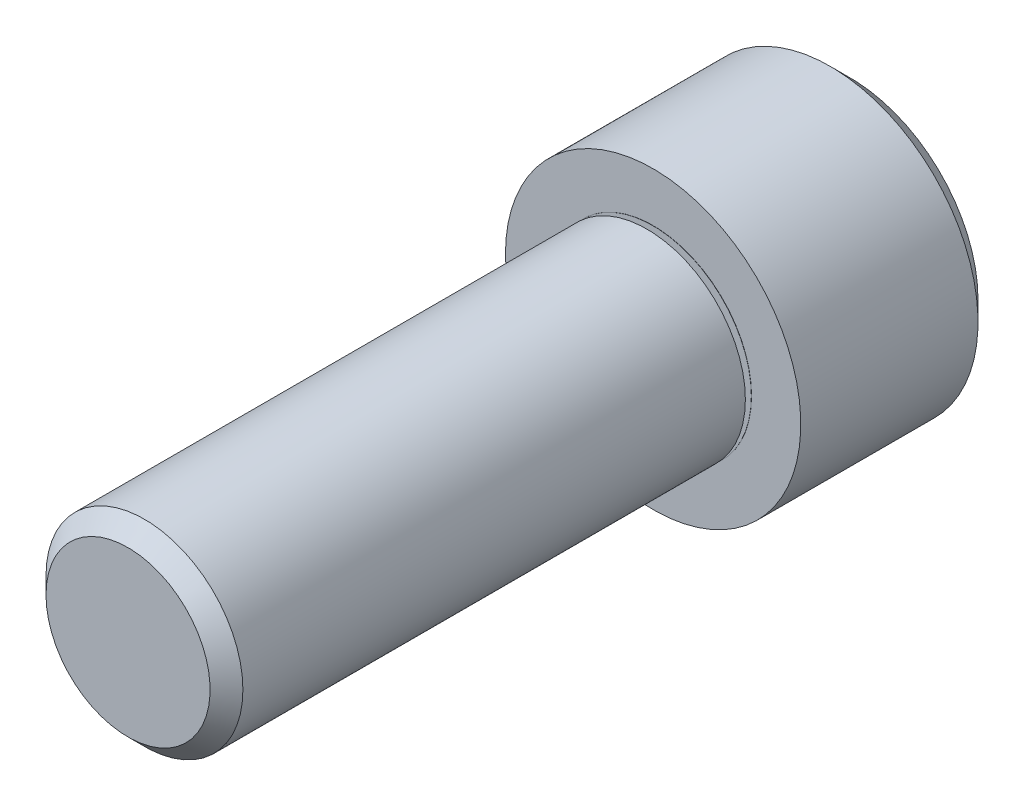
from build123d import *

# Parameters (mm, degrees)
CUT_EXTRUDE1_DEPTH = 4.7625


with BuildPart() as part:
    # Logo3_bib1 → Revolve1 (revolve)
    with BuildSketch(Plane(origin=(0, 0, 0), x_dir=(-1, 0, 0), z_dir=(0, -1, 0))):
        with BuildLine():
            Line((0, -25.4), (0, 9.525))
            Line((0, 9.525), (6.19125, 9.525))
            Line((6.19125, 9.525), (7.14375, 8.5725))
            Line((7.14375, 8.5725), (7.14375, 0))
            Line((7.14375, 0), (4.7625, 0))
            Line((4.7625, 0), (4.7625, -0.01))
            Line((4.7625, -0.01), (4.082175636, -0.01))
            ThreePointArc((4.082175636, -0.01), (4.062479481, -0.026527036), (4.075335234, -0.048793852))
            Line((4.075335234, -0.048793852), (4.7625, -0.298901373))
            Line((4.7625, -0.298901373), (4.7625, -24.60625))
            Line((4.7625, -24.60625), (3.96875, -25.4))
            Line((3.96875, -25.4), (0, -25.4))
        make_face()
    revolve(axis=Axis((0, 0, -10.585154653), (0, 0, 1)))

    # Logo3_bib2 → Cut-Extrude1 (cut)
    with BuildSketch(Plane(origin=(0, 0, -9.525), x_dir=(1, 0, 0), z_dir=(0, 0, -1))):
        Polygon((4.575385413, 0), (2.287692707, 3.9624), (-2.287692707, 3.9624), (-4.575385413, 0), (-2.287692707, -3.9624), (2.287692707, -3.9624), align=None)
    extrude(amount=-CUT_EXTRUDE1_DEPTH, mode=Mode.SUBTRACT)


solid = part.part
